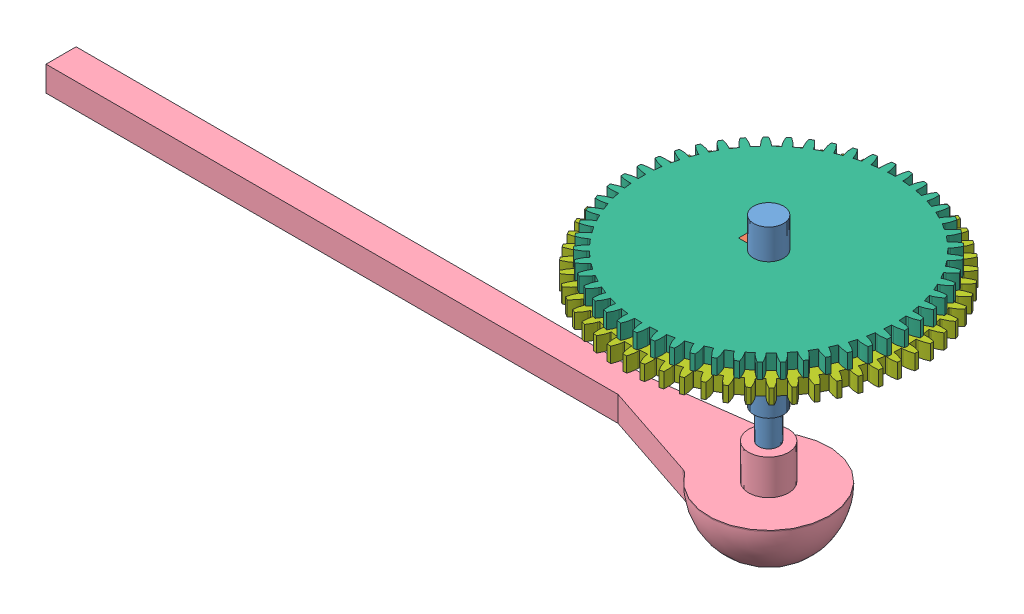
SolidWorks assembly Axle Assembly N.SLDASM, configuration Default (file format 6000). Lengths in mm.
Overall size (86.75 29.1 29.5).
9 component instances, 7 part files, 24 mates.
Components (placement in the parent):
- Axle N-1: Axle N.SLDPRT [Default] at (-18.2485 -12.5354 10.2207) size (3 23 3)
- Key-1: Key.SLDPRT [Default] at (-18.2485 0.9646 10.2207) x (-1 0 0) z (0 0 1) size (2 1.5 1)
- Key-2: Key.SLDPRT [Default] at (-18.2485 -3.5354 10.2207) size (2 1.5 1)
- Key-3: Key.SLDPRT [Default] at (-18.2485 -2.0354 10.2207) size (2 1.5 1)
- Spacer 6mm-1: Spacer 6mm.SLDPRT [Default] at (-16.7485 -9.5354 10.2207) x (0 0 1) z (-1 0 0) size (4 6 4)
- Pointer Back Large Inner-1: Pointer Back Large Inner.SLDPRT [Default] at (-16.7485 -15.5354 10.2207) x (0 0 -1) z (-1 0 0) size (12 9.6 78)
- Gear 15T-2: Gear 15T.sldprt [Default] at (-16.7485 -2.0354 10.2207) x (0 0 1) z (1 0 0) size (8.48 1.5 8.44)
- Gear 53T-2: Gear 53T.sldprt [Default] at (-16.7485 -0.5354 10.2207) x (0 0 -1) z (1 0 0) size (27.5 1.5 27.49)
- Gear 57T-2: Gear 57T.sldprt [Default] at (-16.7485 -0.5354 10.2207) x (0 0 1) z (1 0 0) size (29.5 1.5 29.49)
Mates (geometry in assembly coordinates):
- Coincident1: coincident anti-aligned: plane of Key-1 through (-18.2485 -0.5354 10.2207) normal (0 -1 0); plane of Key-3 through (-18.2485 -0.5354 10.2207) normal (0 1 0)
- Coincident2: coincident aligned: plane of Key-1 through (-17.2485 -0.5354 10.7207) normal (1 0 0); plane of Key-3 through (-17.2485 -0.5354 10.7207) normal (1 0 0)
- Coincident3: coincident aligned: plane of Key-1 through (-17.2485 -0.5354 10.7207) normal (0 0 1); plane of Key-3 through (-19.2485 -0.5354 10.7207) normal (0 0 1)
- Coincident4: coincident anti-aligned: plane of Key-2 through (-18.2485 -2.0354 10.2207) normal (0 1 0); plane of Key-3 through (-18.2485 -2.0354 10.2207) normal (0 -1 0)
- Coincident5: coincident aligned: plane of Key-2 through (-17.2485 -2.0354 10.7207) normal (1 0 0); plane of Key-3 through (-17.2485 -0.5354 10.7207) normal (1 0 0)
- Coincident7: coincident aligned: plane of Key-2 through (-19.2485 -2.0354 10.7207) normal (0 0 1); plane of Key-3 through (-19.2485 -0.5354 10.7207) normal (0 0 1)
- Coincident8: coincident anti-aligned: plane of Axle N-1 through (-17.2485 -12.5354 10.2207) normal (-1 0 0); plane of Key-2 through (-17.2485 -2.0354 10.7207) normal (1 0 0)
- Coincident9: coincident anti-aligned: plane of Axle N-1 through (-17.2485 -3.5354 9.7207) normal (0 0 1); plane of Key-3 through (-19.2485 -0.5354 9.7207) normal (0 0 -1)
- Coincident10: coincident anti-aligned: plane of Axle N-1 through (-17.2485 -3.5354 9.7207) normal (0 1 0); plane of Key-2 through (-18.2485 -3.5354 10.2207) normal (0 -1 0)
- Concentric4: concentric aligned: cylinder of Axle N-1 through (-16.7485 3.9646 10.2207) axis (0 -1 0) radius 1.5; cylinder of Spacer 6mm-1 through (-16.7485 -3.5354 10.2207) axis (0 -1 0) radius 1.5
- Coincident20: coincident anti-aligned: plane of Key-2 through (-18.2485 -3.5354 10.2207) normal (0 -1 0); plane of Spacer 6mm-1 through (-16.7485 -3.5354 10.2207) normal (0 1 0)
- Parallel2: parallel anti-aligned: line of Key-2 through (-19.2485 -3.5354 10.7207) axis (1 0 0); line of Spacer 6mm-1 through (-16.7485 -9.5354 10.2207) axis (-1 0 0)
- Coincident22: coincident aligned: plane of Key-2 through (-18.2485 -3.5354 10.2207) normal (0 -1 0); plane of Gear 15T-2 through (-15.6215 -3.5354 5.2762) normal (0 -1 0)
- Concentric6: concentric anti-aligned: cylinder of Axle N-1 through (-16.7485 3.9646 10.2207) axis (0 -1 0) radius 1.5; cylinder of Gear 15T-2 through (-16.7485 -3.5354 10.2207) axis (0 1 0) radius 1.5
- Parallel3: parallel anti-aligned: line of Key-3 through (-19.2485 -2.0354 9.7207) axis (0 0 1); line of Gear 15T-2 through (-19.2485 -2.0354 10.7207) axis (0 0 -1)
- Coincident24: coincident anti-aligned: plane of Gear 15T-2 through (-15.6215 -2.0354 5.2762) normal (0 1 0); plane of Gear 57T-2 through (-11.6766 -2.0354 -9.4877) normal (0 -1 0)
- Concentric7: concentric anti-aligned: cylinder of Axle N-1 through (-16.7485 3.9646 10.2207) axis (0 -1 0) radius 1.5; cylinder of Gear 57T-2 through (-16.7485 -2.0354 10.2207) axis (0 1 0) radius 1.5
- Parallel4: parallel anti-aligned: line of Key-3 through (-19.2485 -0.5354 9.7207) axis (0 0 1); line of Gear 57T-2 through (-19.2485 -0.5354 10.7207) axis (0 0 -1)
- Coincident26: coincident aligned: plane of Key-1 through (-18.2485 0.9646 10.2207) normal (0 1 0); plane of Gear 53T-2 through (-11.8645 0.9646 28.7421) normal (0 1 0)
- Concentric8: concentric aligned: cylinder of Axle N-1 through (-16.7485 3.9646 10.2207) axis (0 -1 0) radius 1.5; cylinder of Gear 53T-2 through (-16.7485 0.9646 10.2207) axis (0 -1 0) radius 1.5
- Coincident27: coincident anti-aligned: line of Key-1 through (-19.2485 0.9646 10.7207) axis (0 0 -1); line of Gear 53T-2 through (-19.2485 0.9646 9.7207) axis (0 0 1)
- Coincident28: coincident: plane of Axle N-1 through (-16.7485 -19.0354 10.2207) normal (0 -1 0); plane of Pointer Back Large Inner-1 through (-20.8687 -19.0354 10.2207) normal (0 1 0)
- Coincident29: coincident: plane of Axle N-1 through (-18.2485 -15.5354 10.9278) normal (0 0 1); plane of Pointer Back Large Inner-1 through (-16.0413 -19.0354 10.9278) normal (0 0 -1)
- Concentric10: concentric aligned: cylinder of Axle N-1 through (-16.7485 -19.0354 10.2207) axis (0 1 0) radius 1; cylinder of Pointer Back Large Inner-1 through (-16.7485 -19.0354 10.2207) axis (0 1 0) radius 2
